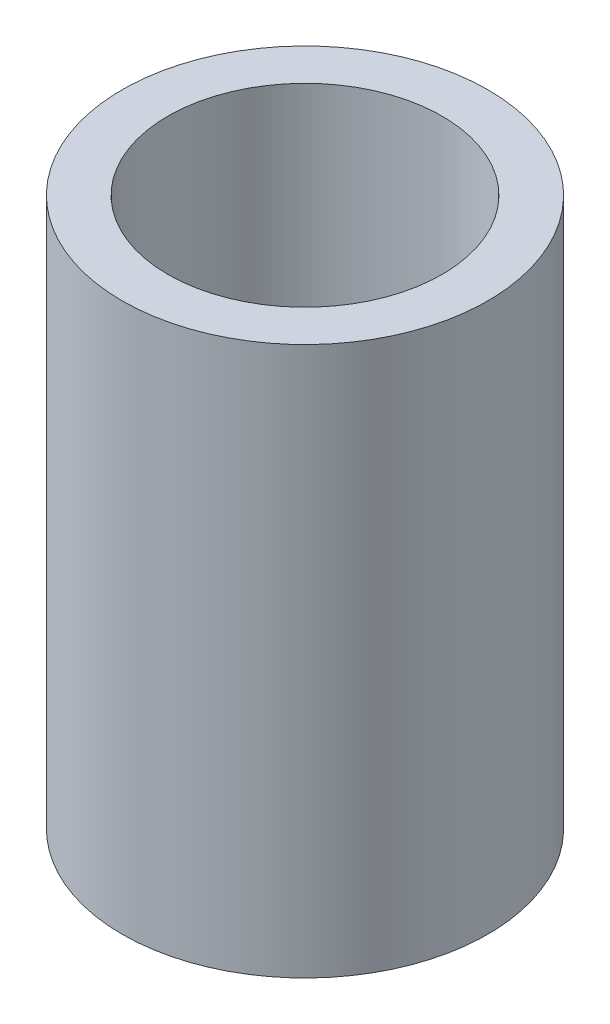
ISO-10303-21;
HEADER;
FILE_DESCRIPTION(('STEP AP214'),'2;1');
FILE_NAME('part.step','',(''),(''),'','','');
FILE_SCHEMA(('AUTOMOTIVE_DESIGN { 1 0 10303 214 1 1 1 1 }'));
ENDSEC;
DATA;
#1=APPLICATION_CONTEXT('core data for automotive mechanical design processes');
#2=APPLICATION_PROTOCOL_DEFINITION('international standard','automotive_design',2000,#1);
#3=PRODUCT_CONTEXT('',#1,'mechanical');
#4=PRODUCT('Part','Part','',(#3));
#5=PRODUCT_RELATED_PRODUCT_CATEGORY('part','',(#4));
#6=PRODUCT_DEFINITION_FORMATION('','',#4);
#7=PRODUCT_DEFINITION_CONTEXT('part definition',#1,'design');
#8=PRODUCT_DEFINITION('design','',#6,#7);
#9=PRODUCT_DEFINITION_SHAPE('','',#8);
#10=(LENGTH_UNIT() NAMED_UNIT(*) SI_UNIT(.MILLI.,.METRE.));
#11=(NAMED_UNIT(*) PLANE_ANGLE_UNIT() SI_UNIT($,.RADIAN.));
#12=(NAMED_UNIT(*) SI_UNIT($,.STERADIAN.) SOLID_ANGLE_UNIT());
#13=UNCERTAINTY_MEASURE_WITH_UNIT(LENGTH_MEASURE(1.E-05),#10,'distance_accuracy_value','');
#14=(GEOMETRIC_REPRESENTATION_CONTEXT(3) GLOBAL_UNCERTAINTY_ASSIGNED_CONTEXT((#13)) GLOBAL_UNIT_ASSIGNED_CONTEXT((#10,
#11,#12)) REPRESENTATION_CONTEXT('',''));
#15=CARTESIAN_POINT('',(0.,0.,0.));
#16=DIRECTION('',(0.,0.,1.));
#17=DIRECTION('',(1.,0.,0.));
#18=AXIS2_PLACEMENT_3D('',#15,#16,#17);
#19=CARTESIAN_POINT('',(0.,6.,0.));
#20=DIRECTION('',(0.,1.,0.));
#21=DIRECTION('',(0.,0.,1.));
#22=AXIS2_PLACEMENT_3D('',#19,#20,#21);
#23=PLANE('',#22);
#24=CARTESIAN_POINT('',(0.,6.,0.));
#25=DIRECTION('',(0.,1.,0.));
#26=DIRECTION('',(0.,0.,1.));
#27=AXIS2_PLACEMENT_3D('',#24,#25,#26);
#28=CIRCLE('',#27,2.);
#29=CARTESIAN_POINT('',(0.,6.,2.));
#30=VERTEX_POINT('',#29);
#31=EDGE_CURVE('E10',#30,#30,#28,.T.);
#32=ORIENTED_EDGE('',*,*,#31,.T.);
#33=EDGE_LOOP('',(#32));
#34=FACE_BOUND('',#33,.T.);
#35=CARTESIAN_POINT('',(0.,6.,0.));
#36=DIRECTION('',(0.,1.,0.));
#37=DIRECTION('',(0.,0.,1.));
#38=AXIS2_PLACEMENT_3D('',#35,#36,#37);
#39=CIRCLE('',#38,1.5);
#40=CARTESIAN_POINT('',(0.,6.,1.5));
#41=VERTEX_POINT('',#40);
#42=EDGE_CURVE('E44',#41,#41,#39,.T.);
#43=ORIENTED_EDGE('',*,*,#42,.F.);
#44=EDGE_LOOP('',(#43));
#45=FACE_BOUND('',#44,.T.);
#46=ADVANCED_FACE('F33',(#34,#45),#23,.T.);
#47=CARTESIAN_POINT('',(0.,0.,0.));
#48=DIRECTION('',(0.,1.,0.));
#49=DIRECTION('',(0.,0.,1.));
#50=AXIS2_PLACEMENT_3D('',#47,#48,#49);
#51=PLANE('',#50);
#52=CARTESIAN_POINT('',(0.,0.,0.));
#53=DIRECTION('',(0.,1.,0.));
#54=DIRECTION('',(0.,0.,1.));
#55=AXIS2_PLACEMENT_3D('',#52,#53,#54);
#56=CIRCLE('',#55,2.);
#57=CARTESIAN_POINT('',(0.,0.,2.));
#58=VERTEX_POINT('',#57);
#59=EDGE_CURVE('E37',#58,#58,#56,.T.);
#60=ORIENTED_EDGE('',*,*,#59,.F.);
#61=EDGE_LOOP('',(#60));
#62=FACE_BOUND('',#61,.T.);
#63=CARTESIAN_POINT('',(0.,0.,0.));
#64=DIRECTION('',(0.,1.,0.));
#65=DIRECTION('',(0.,0.,1.));
#66=AXIS2_PLACEMENT_3D('',#63,#64,#65);
#67=CIRCLE('',#66,1.5);
#68=CARTESIAN_POINT('',(0.,0.,1.5));
#69=VERTEX_POINT('',#68);
#70=EDGE_CURVE('E46',#69,#69,#67,.T.);
#71=ORIENTED_EDGE('',*,*,#70,.T.);
#72=EDGE_LOOP('',(#71));
#73=FACE_BOUND('',#72,.T.);
#74=ADVANCED_FACE('F56',(#62,#73),#51,.F.);
#75=CARTESIAN_POINT('',(0.,6.,0.));
#76=DIRECTION('',(0.,-1.,0.));
#77=DIRECTION('',(0.,0.,-1.));
#78=AXIS2_PLACEMENT_3D('',#75,#76,#77);
#79=CYLINDRICAL_SURFACE('',#78,2.);
#80=ORIENTED_EDGE('',*,*,#31,.F.);
#81=EDGE_LOOP('',(#80));
#82=FACE_BOUND('',#81,.T.);
#83=ORIENTED_EDGE('',*,*,#59,.T.);
#84=EDGE_LOOP('',(#83));
#85=FACE_BOUND('',#84,.T.);
#86=ADVANCED_FACE('F35',(#82,#85),#79,.T.);
#87=CARTESIAN_POINT('',(0.,6.,0.));
#88=DIRECTION('',(0.,-1.,0.));
#89=DIRECTION('',(0.,0.,-1.));
#90=AXIS2_PLACEMENT_3D('',#87,#88,#89);
#91=CYLINDRICAL_SURFACE('',#90,1.5);
#92=ORIENTED_EDGE('',*,*,#42,.T.);
#93=EDGE_LOOP('',(#92));
#94=FACE_BOUND('',#93,.T.);
#95=ORIENTED_EDGE('',*,*,#70,.F.);
#96=EDGE_LOOP('',(#95));
#97=FACE_BOUND('',#96,.T.);
#98=ADVANCED_FACE('F52',(#94,#97),#91,.F.);
#99=CLOSED_SHELL('',(#46,#74,#86,#98));
#100=MANIFOLD_SOLID_BREP('B2',#99);
#101=ADVANCED_BREP_SHAPE_REPRESENTATION('',(#18,#100),#14);
#102=SHAPE_DEFINITION_REPRESENTATION(#9,#101);
ENDSEC;
END-ISO-10303-21;
